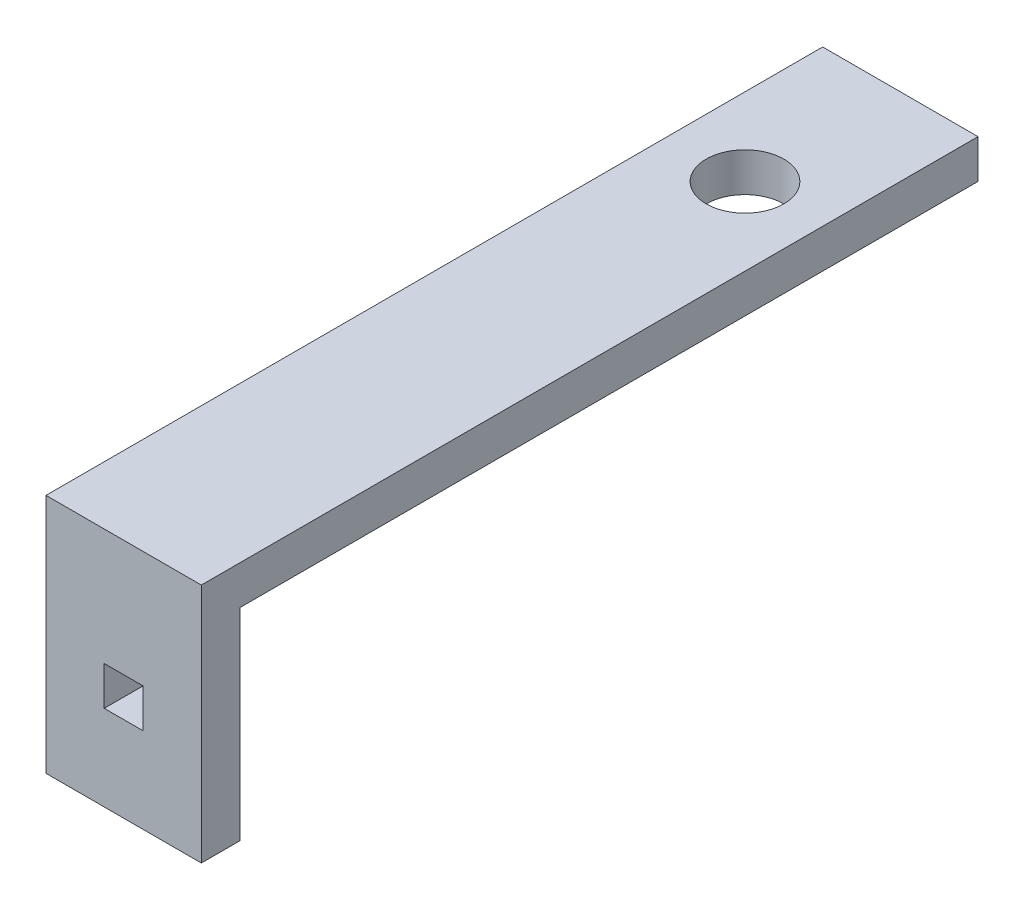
ISO-10303-21;
HEADER;
FILE_DESCRIPTION(('STEP AP214'),'2;1');
FILE_NAME('part.step','',(''),(''),'','','');
FILE_SCHEMA(('AUTOMOTIVE_DESIGN { 1 0 10303 214 1 1 1 1 }'));
ENDSEC;
DATA;
#1=APPLICATION_CONTEXT('core data for automotive mechanical design processes');
#2=APPLICATION_PROTOCOL_DEFINITION('international standard','automotive_design',2000,#1);
#3=PRODUCT_CONTEXT('',#1,'mechanical');
#4=PRODUCT('Part','Part','',(#3));
#5=PRODUCT_RELATED_PRODUCT_CATEGORY('part','',(#4));
#6=PRODUCT_DEFINITION_FORMATION('','',#4);
#7=PRODUCT_DEFINITION_CONTEXT('part definition',#1,'design');
#8=PRODUCT_DEFINITION('design','',#6,#7);
#9=PRODUCT_DEFINITION_SHAPE('','',#8);
#10=(LENGTH_UNIT() NAMED_UNIT(*) SI_UNIT(.MILLI.,.METRE.));
#11=(NAMED_UNIT(*) PLANE_ANGLE_UNIT() SI_UNIT($,.RADIAN.));
#12=(NAMED_UNIT(*) SI_UNIT($,.STERADIAN.) SOLID_ANGLE_UNIT());
#13=UNCERTAINTY_MEASURE_WITH_UNIT(LENGTH_MEASURE(1.E-05),#10,'distance_accuracy_value','');
#14=(GEOMETRIC_REPRESENTATION_CONTEXT(3) GLOBAL_UNCERTAINTY_ASSIGNED_CONTEXT((#13)) GLOBAL_UNIT_ASSIGNED_CONTEXT((#10,
#11,#12)) REPRESENTATION_CONTEXT('',''));
#15=CARTESIAN_POINT('',(0.,0.,0.));
#16=DIRECTION('',(0.,0.,1.));
#17=DIRECTION('',(1.,0.,0.));
#18=AXIS2_PLACEMENT_3D('',#15,#16,#17);
#19=CARTESIAN_POINT('',(32.8097286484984,8.30815280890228,-70.8391776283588));
#20=DIRECTION('',(0.,0.,1.));
#21=DIRECTION('',(1.,0.,0.));
#22=AXIS2_PLACEMENT_3D('',#19,#20,#21);
#23=PLANE('',#22);
#24=DIRECTION('',(0.,1.,0.));
#25=VECTOR('',#24,1.);
#26=CARTESIAN_POINT('',(12.8097286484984,8.30815280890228,-70.8391776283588));
#27=LINE('',#26,#25);
#28=CARTESIAN_POINT('',(12.8097286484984,8.30815280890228,-70.8391776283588));
#29=VERTEX_POINT('',#28);
#30=CARTESIAN_POINT('',(12.8097286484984,13.3081528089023,-70.8391776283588));
#31=VERTEX_POINT('',#30);
#32=EDGE_CURVE('E149',#29,#31,#27,.T.);
#33=ORIENTED_EDGE('',*,*,#32,.T.);
#34=DIRECTION('',(-1.,0.,0.));
#35=VECTOR('',#34,1.);
#36=CARTESIAN_POINT('',(32.8097286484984,13.3081528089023,-70.8391776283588));
#37=LINE('',#36,#35);
#38=CARTESIAN_POINT('',(32.8097286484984,13.3081528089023,-70.8391776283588));
#39=VERTEX_POINT('',#38);
#40=EDGE_CURVE('E11',#39,#31,#37,.T.);
#41=ORIENTED_EDGE('',*,*,#40,.F.);
#42=DIRECTION('',(0.,1.,0.));
#43=VECTOR('',#42,1.);
#44=CARTESIAN_POINT('',(32.8097286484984,8.30815280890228,-70.8391776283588));
#45=LINE('',#44,#43);
#46=CARTESIAN_POINT('',(32.8097286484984,8.30815280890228,-70.8391776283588));
#47=VERTEX_POINT('',#46);
#48=EDGE_CURVE('E150',#47,#39,#45,.T.);
#49=ORIENTED_EDGE('',*,*,#48,.F.);
#50=DIRECTION('',(-1.,0.,0.));
#51=VECTOR('',#50,1.);
#52=CARTESIAN_POINT('',(32.8097286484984,8.30815280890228,-70.8391776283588));
#53=LINE('',#52,#51);
#54=EDGE_CURVE('E164',#47,#29,#53,.T.);
#55=ORIENTED_EDGE('',*,*,#54,.T.);
#56=EDGE_LOOP('',(#33,#41,#49,#55));
#57=FACE_BOUND('',#56,.T.);
#58=ADVANCED_FACE('F31',(#57),#23,.F.);
#59=CARTESIAN_POINT('',(32.8097286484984,13.3081528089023,-70.8391776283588));
#60=DIRECTION('',(0.,-1.,0.));
#61=DIRECTION('',(0.,0.,-1.));
#62=AXIS2_PLACEMENT_3D('',#59,#60,#61);
#63=PLANE('',#62);
#64=CARTESIAN_POINT('',(22.8097286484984,13.3081528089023,-50.8391776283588));
#65=DIRECTION('',(0.,1.,0.));
#66=DIRECTION('',(0.,0.,1.));
#67=AXIS2_PLACEMENT_3D('',#64,#65,#66);
#68=CIRCLE('',#67,5.);
#69=CARTESIAN_POINT('',(22.8097286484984,13.3081528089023,-45.8391776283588));
#70=VERTEX_POINT('',#69);
#71=EDGE_CURVE('E121',#70,#70,#68,.T.);
#72=ORIENTED_EDGE('',*,*,#71,.F.);
#73=EDGE_LOOP('',(#72));
#74=FACE_BOUND('',#73,.T.);
#75=DIRECTION('',(0.,0.,1.));
#76=VECTOR('',#75,1.);
#77=CARTESIAN_POINT('',(12.8097286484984,13.3081528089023,-70.8391776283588));
#78=LINE('',#77,#76);
#79=CARTESIAN_POINT('',(12.8097286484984,13.3081528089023,29.1608223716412));
#80=VERTEX_POINT('',#79);
#81=EDGE_CURVE('E167',#31,#80,#78,.T.);
#82=ORIENTED_EDGE('',*,*,#81,.T.);
#83=DIRECTION('',(-1.,0.,0.));
#84=VECTOR('',#83,1.);
#85=CARTESIAN_POINT('',(32.8097286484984,13.3081528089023,29.1608223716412));
#86=LINE('',#85,#84);
#87=CARTESIAN_POINT('',(32.8097286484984,13.3081528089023,29.1608223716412));
#88=VERTEX_POINT('',#87);
#89=EDGE_CURVE('E38',#88,#80,#86,.T.);
#90=ORIENTED_EDGE('',*,*,#89,.F.);
#91=DIRECTION('',(0.,0.,1.));
#92=VECTOR('',#91,1.);
#93=CARTESIAN_POINT('',(32.8097286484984,13.3081528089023,-70.8391776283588));
#94=LINE('',#93,#92);
#95=EDGE_CURVE('E153',#39,#88,#94,.T.);
#96=ORIENTED_EDGE('',*,*,#95,.F.);
#97=ORIENTED_EDGE('',*,*,#40,.T.);
#98=EDGE_LOOP('',(#82,#90,#96,#97));
#99=FACE_BOUND('',#98,.T.);
#100=ADVANCED_FACE('F212',(#74,#99),#63,.F.);
#101=CARTESIAN_POINT('',(32.8097286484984,13.3081528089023,29.1608223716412));
#102=DIRECTION('',(0.,0.,-1.));
#103=DIRECTION('',(0.,1.,0.));
#104=AXIS2_PLACEMENT_3D('',#101,#102,#103);
#105=PLANE('',#104);
#106=DIRECTION('',(1.,0.,0.));
#107=VECTOR('',#106,1.);
#108=CARTESIAN_POINT('',(20.3097286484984,-6.69106139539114,29.1608223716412));
#109=LINE('',#108,#107);
#110=CARTESIAN_POINT('',(20.3097286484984,-6.69106139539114,29.1608223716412));
#111=VERTEX_POINT('',#110);
#112=CARTESIAN_POINT('',(25.3097286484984,-6.69106139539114,29.1608223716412));
#113=VERTEX_POINT('',#112);
#114=EDGE_CURVE('E129',#111,#113,#109,.T.);
#115=ORIENTED_EDGE('',*,*,#114,.F.);
#116=DIRECTION('',(0.,-1.,0.));
#117=VECTOR('',#116,1.);
#118=CARTESIAN_POINT('',(20.3097286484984,-1.69106139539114,29.1608223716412));
#119=LINE('',#118,#117);
#120=CARTESIAN_POINT('',(20.3097286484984,-1.69106139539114,29.1608223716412));
#121=VERTEX_POINT('',#120);
#122=EDGE_CURVE('E45',#121,#111,#119,.T.);
#123=ORIENTED_EDGE('',*,*,#122,.F.);
#124=DIRECTION('',(-1.,0.,0.));
#125=VECTOR('',#124,1.);
#126=CARTESIAN_POINT('',(20.3097286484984,-1.69106139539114,29.1608223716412));
#127=LINE('',#126,#125);
#128=CARTESIAN_POINT('',(25.3097286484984,-1.69106139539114,29.1608223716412));
#129=VERTEX_POINT('',#128);
#130=EDGE_CURVE('E115',#129,#121,#127,.T.);
#131=ORIENTED_EDGE('',*,*,#130,.F.);
#132=DIRECTION('',(0.,1.,0.));
#133=VECTOR('',#132,1.);
#134=CARTESIAN_POINT('',(25.3097286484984,-1.69106139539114,29.1608223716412));
#135=LINE('',#134,#133);
#136=EDGE_CURVE('E135',#113,#129,#135,.T.);
#137=ORIENTED_EDGE('',*,*,#136,.F.);
#138=EDGE_LOOP('',(#115,#123,#131,#137));
#139=FACE_BOUND('',#138,.T.);
#140=DIRECTION('',(0.,-1.,0.));
#141=VECTOR('',#140,1.);
#142=CARTESIAN_POINT('',(12.8097286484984,13.3081528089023,29.1608223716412));
#143=LINE('',#142,#141);
#144=CARTESIAN_POINT('',(12.8097286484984,-17.6910613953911,29.1608223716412));
#145=VERTEX_POINT('',#144);
#146=EDGE_CURVE('E169',#80,#145,#143,.T.);
#147=ORIENTED_EDGE('',*,*,#146,.T.);
#148=DIRECTION('',(-1.,0.,0.));
#149=VECTOR('',#148,1.);
#150=CARTESIAN_POINT('',(32.8097286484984,-17.6910613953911,29.1608223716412));
#151=LINE('',#150,#149);
#152=CARTESIAN_POINT('',(32.8097286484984,-17.6910613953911,29.1608223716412));
#153=VERTEX_POINT('',#152);
#154=EDGE_CURVE('E184',#153,#145,#151,.T.);
#155=ORIENTED_EDGE('',*,*,#154,.F.);
#156=DIRECTION('',(0.,-1.,0.));
#157=VECTOR('',#156,1.);
#158=CARTESIAN_POINT('',(32.8097286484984,13.3081528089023,29.1608223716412));
#159=LINE('',#158,#157);
#160=EDGE_CURVE('E156',#88,#153,#159,.T.);
#161=ORIENTED_EDGE('',*,*,#160,.F.);
#162=ORIENTED_EDGE('',*,*,#89,.T.);
#163=EDGE_LOOP('',(#147,#155,#161,#162));
#164=FACE_BOUND('',#163,.T.);
#165=ADVANCED_FACE('F191',(#139,#164),#105,.F.);
#166=CARTESIAN_POINT('',(32.8097286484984,-17.6910613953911,29.1608223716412));
#167=DIRECTION('',(0.,1.,0.));
#168=DIRECTION('',(0.,0.,1.));
#169=AXIS2_PLACEMENT_3D('',#166,#167,#168);
#170=PLANE('',#169);
#171=DIRECTION('',(0.,0.,-1.));
#172=VECTOR('',#171,1.);
#173=CARTESIAN_POINT('',(12.8097286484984,-17.6910613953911,29.1608223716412));
#174=LINE('',#173,#172);
#175=CARTESIAN_POINT('',(12.8097286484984,-17.6910613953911,24.1608223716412));
#176=VERTEX_POINT('',#175);
#177=EDGE_CURVE('E171',#145,#176,#174,.T.);
#178=ORIENTED_EDGE('',*,*,#177,.T.);
#179=DIRECTION('',(-1.,0.,0.));
#180=VECTOR('',#179,1.);
#181=CARTESIAN_POINT('',(32.8097286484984,-17.6910613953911,24.1608223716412));
#182=LINE('',#181,#180);
#183=CARTESIAN_POINT('',(32.8097286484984,-17.6910613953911,24.1608223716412));
#184=VERTEX_POINT('',#183);
#185=EDGE_CURVE('E181',#184,#176,#182,.T.);
#186=ORIENTED_EDGE('',*,*,#185,.F.);
#187=DIRECTION('',(0.,0.,-1.));
#188=VECTOR('',#187,1.);
#189=CARTESIAN_POINT('',(32.8097286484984,-17.6910613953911,29.1608223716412));
#190=LINE('',#189,#188);
#191=EDGE_CURVE('E158',#153,#184,#190,.T.);
#192=ORIENTED_EDGE('',*,*,#191,.F.);
#193=ORIENTED_EDGE('',*,*,#154,.T.);
#194=EDGE_LOOP('',(#178,#186,#192,#193));
#195=FACE_BOUND('',#194,.T.);
#196=ADVANCED_FACE('F202',(#195),#170,.F.);
#197=CARTESIAN_POINT('',(32.8097286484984,-17.6910613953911,24.1608223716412));
#198=DIRECTION('',(0.,0.,1.));
#199=DIRECTION('',(0.,-1.,0.));
#200=AXIS2_PLACEMENT_3D('',#197,#198,#199);
#201=PLANE('',#200);
#202=DIRECTION('',(1.,0.,0.));
#203=VECTOR('',#202,1.);
#204=CARTESIAN_POINT('',(20.3097286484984,-1.69106139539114,24.1608223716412));
#205=LINE('',#204,#203);
#206=CARTESIAN_POINT('',(20.3097286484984,-1.69106139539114,24.1608223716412));
#207=VERTEX_POINT('',#206);
#208=CARTESIAN_POINT('',(25.3097286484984,-1.69106139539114,24.1608223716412));
#209=VERTEX_POINT('',#208);
#210=EDGE_CURVE('E127',#207,#209,#205,.T.);
#211=ORIENTED_EDGE('',*,*,#210,.F.);
#212=DIRECTION('',(0.,1.,0.));
#213=VECTOR('',#212,1.);
#214=CARTESIAN_POINT('',(20.3097286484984,-1.69106139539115,24.1608223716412));
#215=LINE('',#214,#213);
#216=CARTESIAN_POINT('',(20.3097286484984,-6.69106139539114,24.1608223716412));
#217=VERTEX_POINT('',#216);
#218=EDGE_CURVE('E109',#217,#207,#215,.T.);
#219=ORIENTED_EDGE('',*,*,#218,.F.);
#220=DIRECTION('',(-1.,0.,0.));
#221=VECTOR('',#220,1.);
#222=CARTESIAN_POINT('',(20.3097286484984,-6.69106139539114,24.1608223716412));
#223=LINE('',#222,#221);
#224=CARTESIAN_POINT('',(25.3097286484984,-6.69106139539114,24.1608223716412));
#225=VERTEX_POINT('',#224);
#226=EDGE_CURVE('E118',#225,#217,#223,.T.);
#227=ORIENTED_EDGE('',*,*,#226,.F.);
#228=DIRECTION('',(0.,-1.,0.));
#229=VECTOR('',#228,1.);
#230=CARTESIAN_POINT('',(25.3097286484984,-1.69106139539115,24.1608223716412));
#231=LINE('',#230,#229);
#232=EDGE_CURVE('E53',#209,#225,#231,.T.);
#233=ORIENTED_EDGE('',*,*,#232,.F.);
#234=EDGE_LOOP('',(#211,#219,#227,#233));
#235=FACE_BOUND('',#234,.T.);
#236=DIRECTION('',(0.,1.,0.));
#237=VECTOR('',#236,1.);
#238=CARTESIAN_POINT('',(12.8097286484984,-17.6910613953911,24.1608223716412));
#239=LINE('',#238,#237);
#240=CARTESIAN_POINT('',(12.8097286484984,8.30815280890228,24.1608223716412));
#241=VERTEX_POINT('',#240);
#242=EDGE_CURVE('E173',#176,#241,#239,.T.);
#243=ORIENTED_EDGE('',*,*,#242,.T.);
#244=DIRECTION('',(-1.,0.,0.));
#245=VECTOR('',#244,1.);
#246=CARTESIAN_POINT('',(32.8097286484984,8.30815280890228,24.1608223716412));
#247=LINE('',#246,#245);
#248=CARTESIAN_POINT('',(32.8097286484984,8.30815280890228,24.1608223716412));
#249=VERTEX_POINT('',#248);
#250=EDGE_CURVE('E178',#249,#241,#247,.T.);
#251=ORIENTED_EDGE('',*,*,#250,.F.);
#252=DIRECTION('',(0.,1.,0.));
#253=VECTOR('',#252,1.);
#254=CARTESIAN_POINT('',(32.8097286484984,-17.6910613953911,24.1608223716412));
#255=LINE('',#254,#253);
#256=EDGE_CURVE('E160',#184,#249,#255,.T.);
#257=ORIENTED_EDGE('',*,*,#256,.F.);
#258=ORIENTED_EDGE('',*,*,#185,.T.);
#259=EDGE_LOOP('',(#243,#251,#257,#258));
#260=FACE_BOUND('',#259,.T.);
#261=ADVANCED_FACE('F124',(#235,#260),#201,.F.);
#262=CARTESIAN_POINT('',(32.8097286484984,8.30815280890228,24.1608223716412));
#263=DIRECTION('',(0.,1.,0.));
#264=DIRECTION('',(0.,0.,1.));
#265=AXIS2_PLACEMENT_3D('',#262,#263,#264);
#266=PLANE('',#265);
#267=CARTESIAN_POINT('',(22.8097286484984,8.30815280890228,-50.8391776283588));
#268=DIRECTION('',(0.,1.,0.));
#269=DIRECTION('',(0.,0.,1.));
#270=AXIS2_PLACEMENT_3D('',#267,#268,#269);
#271=CIRCLE('',#270,5.);
#272=CARTESIAN_POINT('',(22.8097286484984,8.30815280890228,-45.8391776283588));
#273=VERTEX_POINT('',#272);
#274=EDGE_CURVE('E146',#273,#273,#271,.F.);
#275=ORIENTED_EDGE('',*,*,#274,.F.);
#276=EDGE_LOOP('',(#275));
#277=FACE_BOUND('',#276,.T.);
#278=DIRECTION('',(0.,0.,-1.));
#279=VECTOR('',#278,1.);
#280=CARTESIAN_POINT('',(12.8097286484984,8.30815280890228,24.1608223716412));
#281=LINE('',#280,#279);
#282=EDGE_CURVE('E154',#241,#29,#281,.T.);
#283=ORIENTED_EDGE('',*,*,#282,.T.);
#284=ORIENTED_EDGE('',*,*,#54,.F.);
#285=DIRECTION('',(0.,0.,-1.));
#286=VECTOR('',#285,1.);
#287=CARTESIAN_POINT('',(32.8097286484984,8.30815280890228,24.1608223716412));
#288=LINE('',#287,#286);
#289=EDGE_CURVE('E162',#249,#47,#288,.T.);
#290=ORIENTED_EDGE('',*,*,#289,.F.);
#291=ORIENTED_EDGE('',*,*,#250,.T.);
#292=EDGE_LOOP('',(#283,#284,#290,#291));
#293=FACE_BOUND('',#292,.T.);
#294=ADVANCED_FACE('F215',(#277,#293),#266,.F.);
#295=CARTESIAN_POINT('',(32.8097286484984,13.3081528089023,-70.8391776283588));
#296=DIRECTION('',(1.,0.,0.));
#297=DIRECTION('',(0.,0.,-1.));
#298=AXIS2_PLACEMENT_3D('',#295,#296,#297);
#299=PLANE('',#298);
#300=ORIENTED_EDGE('',*,*,#48,.T.);
#301=ORIENTED_EDGE('',*,*,#95,.T.);
#302=ORIENTED_EDGE('',*,*,#160,.T.);
#303=ORIENTED_EDGE('',*,*,#191,.T.);
#304=ORIENTED_EDGE('',*,*,#256,.T.);
#305=ORIENTED_EDGE('',*,*,#289,.T.);
#306=EDGE_LOOP('',(#300,#301,#302,#303,#304,#305));
#307=FACE_BOUND('',#306,.T.);
#308=ADVANCED_FACE('F208',(#307),#299,.T.);
#309=CARTESIAN_POINT('',(12.8097286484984,13.3081528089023,-70.8391776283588));
#310=DIRECTION('',(1.,0.,0.));
#311=DIRECTION('',(0.,0.,-1.));
#312=AXIS2_PLACEMENT_3D('',#309,#310,#311);
#313=PLANE('',#312);
#314=ORIENTED_EDGE('',*,*,#32,.F.);
#315=ORIENTED_EDGE('',*,*,#282,.F.);
#316=ORIENTED_EDGE('',*,*,#242,.F.);
#317=ORIENTED_EDGE('',*,*,#177,.F.);
#318=ORIENTED_EDGE('',*,*,#146,.F.);
#319=ORIENTED_EDGE('',*,*,#81,.F.);
#320=EDGE_LOOP('',(#314,#315,#316,#317,#318,#319));
#321=FACE_BOUND('',#320,.T.);
#322=ADVANCED_FACE('F197',(#321),#313,.F.);
#323=CARTESIAN_POINT('',(22.8097286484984,-17.6920613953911,-50.8391776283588));
#324=DIRECTION('',(0.,1.,0.));
#325=DIRECTION('',(0.,0.,1.));
#326=AXIS2_PLACEMENT_3D('',#323,#324,#325);
#327=CYLINDRICAL_SURFACE('',#326,5.);
#328=ORIENTED_EDGE('',*,*,#71,.T.);
#329=EDGE_LOOP('',(#328));
#330=FACE_BOUND('',#329,.T.);
#331=ORIENTED_EDGE('',*,*,#274,.T.);
#332=EDGE_LOOP('',(#331));
#333=FACE_BOUND('',#332,.T.);
#334=ADVANCED_FACE('F263',(#330,#333),#327,.F.);
#335=CARTESIAN_POINT('',(20.3097286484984,-1.69106139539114,-70.8401776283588));
#336=DIRECTION('',(-1.,0.,0.));
#337=DIRECTION('',(0.,0.,1.));
#338=AXIS2_PLACEMENT_3D('',#335,#336,#337);
#339=PLANE('',#338);
#340=ORIENTED_EDGE('',*,*,#218,.T.);
#341=DIRECTION('',(0.,0.,1.));
#342=VECTOR('',#341,1.);
#343=CARTESIAN_POINT('',(20.3097286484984,-1.69106139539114,-70.8401776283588));
#344=LINE('',#343,#342);
#345=EDGE_CURVE('E122',#207,#121,#344,.T.);
#346=ORIENTED_EDGE('',*,*,#345,.T.);
#347=ORIENTED_EDGE('',*,*,#122,.T.);
#348=DIRECTION('',(0.,0.,1.));
#349=VECTOR('',#348,1.);
#350=CARTESIAN_POINT('',(20.3097286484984,-6.69106139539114,-70.8401776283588));
#351=LINE('',#350,#349);
#352=EDGE_CURVE('E105',#217,#111,#351,.T.);
#353=ORIENTED_EDGE('',*,*,#352,.F.);
#354=EDGE_LOOP('',(#340,#346,#347,#353));
#355=FACE_BOUND('',#354,.T.);
#356=ADVANCED_FACE('F107',(#355),#339,.F.);
#357=CARTESIAN_POINT('',(20.3097286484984,-1.69106139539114,-70.8401776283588));
#358=DIRECTION('',(0.,1.,0.));
#359=DIRECTION('',(0.,0.,1.));
#360=AXIS2_PLACEMENT_3D('',#357,#358,#359);
#361=PLANE('',#360);
#362=ORIENTED_EDGE('',*,*,#210,.T.);
#363=DIRECTION('',(0.,0.,1.));
#364=VECTOR('',#363,1.);
#365=CARTESIAN_POINT('',(25.3097286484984,-1.69106139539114,-70.8401776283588));
#366=LINE('',#365,#364);
#367=EDGE_CURVE('E141',#209,#129,#366,.T.);
#368=ORIENTED_EDGE('',*,*,#367,.T.);
#369=ORIENTED_EDGE('',*,*,#130,.T.);
#370=ORIENTED_EDGE('',*,*,#345,.F.);
#371=EDGE_LOOP('',(#362,#368,#369,#370));
#372=FACE_BOUND('',#371,.T.);
#373=ADVANCED_FACE('F262',(#372),#361,.F.);
#374=CARTESIAN_POINT('',(25.3097286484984,-1.69106139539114,-70.8401776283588));
#375=DIRECTION('',(1.,0.,0.));
#376=DIRECTION('',(0.,0.,-1.));
#377=AXIS2_PLACEMENT_3D('',#374,#375,#376);
#378=PLANE('',#377);
#379=ORIENTED_EDGE('',*,*,#232,.T.);
#380=DIRECTION('',(0.,0.,1.));
#381=VECTOR('',#380,1.);
#382=CARTESIAN_POINT('',(25.3097286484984,-6.69106139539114,-70.8401776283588));
#383=LINE('',#382,#381);
#384=EDGE_CURVE('E114',#225,#113,#383,.T.);
#385=ORIENTED_EDGE('',*,*,#384,.T.);
#386=ORIENTED_EDGE('',*,*,#136,.T.);
#387=ORIENTED_EDGE('',*,*,#367,.F.);
#388=EDGE_LOOP('',(#379,#385,#386,#387));
#389=FACE_BOUND('',#388,.T.);
#390=ADVANCED_FACE('F274',(#389),#378,.F.);
#391=CARTESIAN_POINT('',(20.3097286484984,-6.69106139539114,-70.8401776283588));
#392=DIRECTION('',(0.,-1.,0.));
#393=DIRECTION('',(0.,0.,-1.));
#394=AXIS2_PLACEMENT_3D('',#391,#392,#393);
#395=PLANE('',#394);
#396=ORIENTED_EDGE('',*,*,#226,.T.);
#397=ORIENTED_EDGE('',*,*,#352,.T.);
#398=ORIENTED_EDGE('',*,*,#114,.T.);
#399=ORIENTED_EDGE('',*,*,#384,.F.);
#400=EDGE_LOOP('',(#396,#397,#398,#399));
#401=FACE_BOUND('',#400,.T.);
#402=ADVANCED_FACE('F119',(#401),#395,.F.);
#403=CLOSED_SHELL('',(#58,#100,#165,#196,#261,#294,#308,#322,#334,#356,#373,#390,#402));
#404=MANIFOLD_SOLID_BREP('B2',#403);
#405=ADVANCED_BREP_SHAPE_REPRESENTATION('',(#18,#404),#14);
#406=SHAPE_DEFINITION_REPRESENTATION(#9,#405);
ENDSEC;
END-ISO-10303-21;
